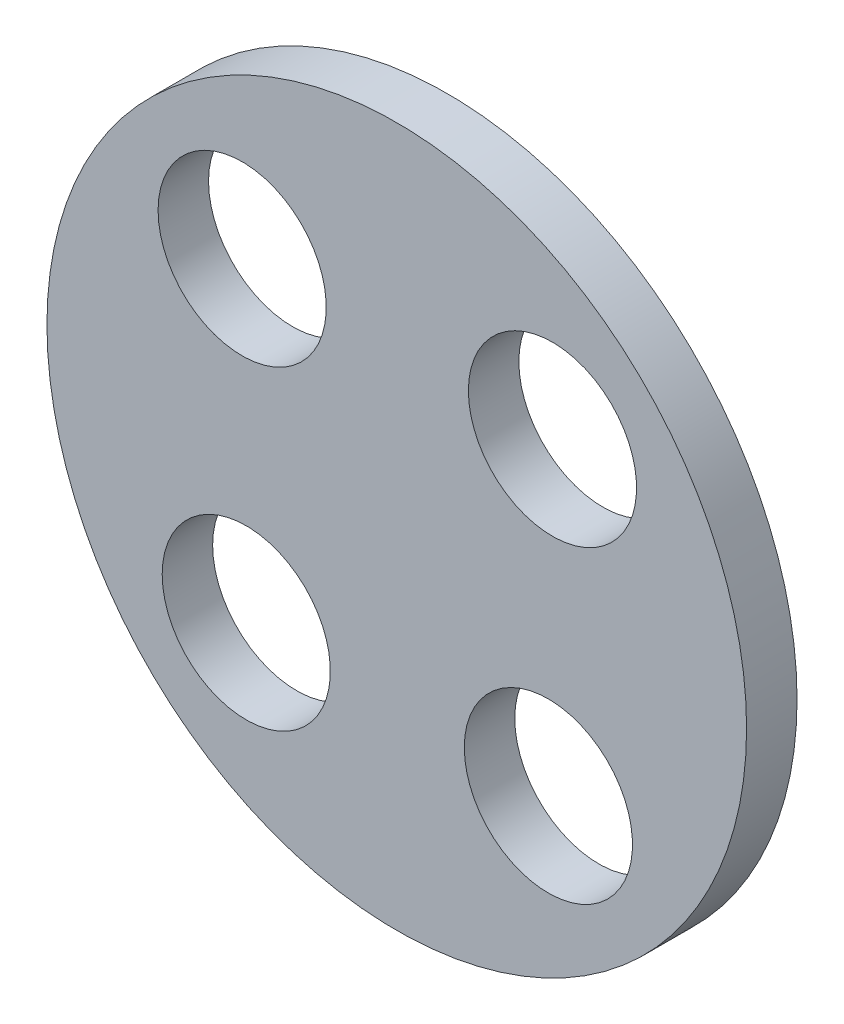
ISO-10303-21;
HEADER;
FILE_DESCRIPTION(('STEP AP214'),'2;1');
FILE_NAME('part.step','',(''),(''),'','','');
FILE_SCHEMA(('AUTOMOTIVE_DESIGN { 1 0 10303 214 1 1 1 1 }'));
ENDSEC;
DATA;
#1=APPLICATION_CONTEXT('core data for automotive mechanical design processes');
#2=APPLICATION_PROTOCOL_DEFINITION('international standard','automotive_design',2000,#1);
#3=PRODUCT_CONTEXT('',#1,'mechanical');
#4=PRODUCT('Part','Part','',(#3));
#5=PRODUCT_RELATED_PRODUCT_CATEGORY('part','',(#4));
#6=PRODUCT_DEFINITION_FORMATION('','',#4);
#7=PRODUCT_DEFINITION_CONTEXT('part definition',#1,'design');
#8=PRODUCT_DEFINITION('design','',#6,#7);
#9=PRODUCT_DEFINITION_SHAPE('','',#8);
#10=(LENGTH_UNIT() NAMED_UNIT(*) SI_UNIT(.MILLI.,.METRE.));
#11=(NAMED_UNIT(*) PLANE_ANGLE_UNIT() SI_UNIT($,.RADIAN.));
#12=(NAMED_UNIT(*) SI_UNIT($,.STERADIAN.) SOLID_ANGLE_UNIT());
#13=UNCERTAINTY_MEASURE_WITH_UNIT(LENGTH_MEASURE(1.E-05),#10,'distance_accuracy_value','');
#14=(GEOMETRIC_REPRESENTATION_CONTEXT(3) GLOBAL_UNCERTAINTY_ASSIGNED_CONTEXT((#13)) GLOBAL_UNIT_ASSIGNED_CONTEXT((#10,
#11,#12)) REPRESENTATION_CONTEXT('',''));
#15=CARTESIAN_POINT('',(0.,0.,0.));
#16=DIRECTION('',(0.,0.,1.));
#17=DIRECTION('',(1.,0.,0.));
#18=AXIS2_PLACEMENT_3D('',#15,#16,#17);
#19=CARTESIAN_POINT('',(0.,0.,3.81));
#20=DIRECTION('',(0.,0.,1.));
#21=DIRECTION('',(1.,0.,0.));
#22=AXIS2_PLACEMENT_3D('',#19,#20,#21);
#23=PLANE('',#22);
#24=CARTESIAN_POINT('',(11.4489030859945,-11.8954915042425,3.81));
#25=DIRECTION('',(0.,0.,1.));
#26=DIRECTION('',(1.,0.,0.));
#27=AXIS2_PLACEMENT_3D('',#24,#25,#26);
#28=CIRCLE('',#27,6.35);
#29=CARTESIAN_POINT('',(5.09890308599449,-11.8954915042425,3.81));
#30=VERTEX_POINT('',#29);
#31=EDGE_CURVE('E55',#30,#30,#28,.T.);
#32=ORIENTED_EDGE('',*,*,#31,.F.);
#33=EDGE_LOOP('',(#32));
#34=FACE_BOUND('',#33,.T.);
#35=CARTESIAN_POINT('',(-11.6743329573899,11.6743329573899,3.81));
#36=DIRECTION('',(0.,0.,1.));
#37=DIRECTION('',(1.,0.,0.));
#38=AXIS2_PLACEMENT_3D('',#35,#36,#37);
#39=CIRCLE('',#38,6.35);
#40=CARTESIAN_POINT('',(-18.0243329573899,11.6743329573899,3.81));
#41=VERTEX_POINT('',#40);
#42=EDGE_CURVE('E40',#41,#41,#39,.T.);
#43=ORIENTED_EDGE('',*,*,#42,.F.);
#44=EDGE_LOOP('',(#43));
#45=FACE_BOUND('',#44,.T.);
#46=CARTESIAN_POINT('',(0.,0.,3.81));
#47=DIRECTION('',(0.,0.,1.));
#48=DIRECTION('',(1.,0.,0.));
#49=AXIS2_PLACEMENT_3D('',#46,#47,#48);
#50=CIRCLE('',#49,26.416);
#51=CARTESIAN_POINT('',(-26.416,0.,3.81));
#52=VERTEX_POINT('',#51);
#53=EDGE_CURVE('E10',#52,#52,#50,.T.);
#54=ORIENTED_EDGE('',*,*,#53,.T.);
#55=EDGE_LOOP('',(#54));
#56=FACE_BOUND('',#55,.T.);
#57=CARTESIAN_POINT('',(11.7568886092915,11.5911893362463,3.81));
#58=DIRECTION('',(0.,0.,1.));
#59=DIRECTION('',(1.,0.,0.));
#60=AXIS2_PLACEMENT_3D('',#57,#58,#59);
#61=CIRCLE('',#60,6.35);
#62=CARTESIAN_POINT('',(5.40688860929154,11.5911893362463,3.81));
#63=VERTEX_POINT('',#62);
#64=EDGE_CURVE('E49',#63,#63,#61,.T.);
#65=ORIENTED_EDGE('',*,*,#64,.F.);
#66=EDGE_LOOP('',(#65));
#67=FACE_BOUND('',#66,.T.);
#68=CARTESIAN_POINT('',(-11.3642808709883,-11.9763608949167,3.81));
#69=DIRECTION('',(0.,0.,1.));
#70=DIRECTION('',(1.,0.,0.));
#71=AXIS2_PLACEMENT_3D('',#68,#69,#70);
#72=CIRCLE('',#71,6.35);
#73=CARTESIAN_POINT('',(-17.7142808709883,-11.9763608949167,3.81));
#74=VERTEX_POINT('',#73);
#75=EDGE_CURVE('E61',#74,#74,#72,.T.);
#76=ORIENTED_EDGE('',*,*,#75,.F.);
#77=EDGE_LOOP('',(#76));
#78=FACE_BOUND('',#77,.T.);
#79=ADVANCED_FACE('F29',(#34,#45,#56,#67,#78),#23,.T.);
#80=CARTESIAN_POINT('',(0.,0.,0.));
#81=DIRECTION('',(0.,0.,1.));
#82=DIRECTION('',(1.,0.,0.));
#83=AXIS2_PLACEMENT_3D('',#80,#81,#82);
#84=PLANE('',#83);
#85=CARTESIAN_POINT('',(11.4489030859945,-11.8954915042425,0.));
#86=DIRECTION('',(0.,0.,1.));
#87=DIRECTION('',(1.,0.,0.));
#88=AXIS2_PLACEMENT_3D('',#85,#86,#87);
#89=CIRCLE('',#88,6.35);
#90=CARTESIAN_POINT('',(5.09890308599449,-11.8954915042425,0.));
#91=VERTEX_POINT('',#90);
#92=EDGE_CURVE('E58',#91,#91,#89,.T.);
#93=ORIENTED_EDGE('',*,*,#92,.T.);
#94=EDGE_LOOP('',(#93));
#95=FACE_BOUND('',#94,.T.);
#96=CARTESIAN_POINT('',(-11.6743329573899,11.6743329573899,0.));
#97=DIRECTION('',(0.,0.,1.));
#98=DIRECTION('',(1.,0.,0.));
#99=AXIS2_PLACEMENT_3D('',#96,#97,#98);
#100=CIRCLE('',#99,6.35);
#101=CARTESIAN_POINT('',(-18.0243329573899,11.6743329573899,0.));
#102=VERTEX_POINT('',#101);
#103=EDGE_CURVE('E44',#102,#102,#100,.T.);
#104=ORIENTED_EDGE('',*,*,#103,.T.);
#105=EDGE_LOOP('',(#104));
#106=FACE_BOUND('',#105,.T.);
#107=CARTESIAN_POINT('',(0.,0.,0.));
#108=DIRECTION('',(0.,0.,1.));
#109=DIRECTION('',(1.,0.,0.));
#110=AXIS2_PLACEMENT_3D('',#107,#108,#109);
#111=CIRCLE('',#110,26.416);
#112=CARTESIAN_POINT('',(-26.416,0.,0.));
#113=VERTEX_POINT('',#112);
#114=EDGE_CURVE('E36',#113,#113,#111,.T.);
#115=ORIENTED_EDGE('',*,*,#114,.F.);
#116=EDGE_LOOP('',(#115));
#117=FACE_BOUND('',#116,.T.);
#118=CARTESIAN_POINT('',(11.7568886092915,11.5911893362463,0.));
#119=DIRECTION('',(0.,0.,1.));
#120=DIRECTION('',(1.,0.,0.));
#121=AXIS2_PLACEMENT_3D('',#118,#119,#120);
#122=CIRCLE('',#121,6.35);
#123=CARTESIAN_POINT('',(5.40688860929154,11.5911893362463,0.));
#124=VERTEX_POINT('',#123);
#125=EDGE_CURVE('E52',#124,#124,#122,.T.);
#126=ORIENTED_EDGE('',*,*,#125,.T.);
#127=EDGE_LOOP('',(#126));
#128=FACE_BOUND('',#127,.T.);
#129=CARTESIAN_POINT('',(-11.3642808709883,-11.9763608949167,0.));
#130=DIRECTION('',(0.,0.,1.));
#131=DIRECTION('',(1.,0.,0.));
#132=AXIS2_PLACEMENT_3D('',#129,#130,#131);
#133=CIRCLE('',#132,6.35);
#134=CARTESIAN_POINT('',(-17.7142808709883,-11.9763608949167,0.));
#135=VERTEX_POINT('',#134);
#136=EDGE_CURVE('E64',#135,#135,#133,.T.);
#137=ORIENTED_EDGE('',*,*,#136,.T.);
#138=EDGE_LOOP('',(#137));
#139=FACE_BOUND('',#138,.T.);
#140=ADVANCED_FACE('F68',(#95,#106,#117,#128,#139),#84,.F.);
#141=CARTESIAN_POINT('',(0.,0.,3.81));
#142=DIRECTION('',(0.,0.,-1.));
#143=DIRECTION('',(-1.,0.,0.));
#144=AXIS2_PLACEMENT_3D('',#141,#142,#143);
#145=CYLINDRICAL_SURFACE('',#144,26.416);
#146=CARTESIAN_POINT('',(-26.416,0.,3.81));
#147=CARTESIAN_POINT('',(-26.416,0.,3.7703125));
#148=CARTESIAN_POINT('',(-26.416,0.,3.730625));
#149=CARTESIAN_POINT('',(-26.416,0.,3.65125));
#150=CARTESIAN_POINT('',(-26.416,0.,3.6115625));
#151=CARTESIAN_POINT('',(-26.416,0.,3.5321875));
#152=CARTESIAN_POINT('',(-26.416,0.,3.4925));
#153=CARTESIAN_POINT('',(-26.416,0.,3.413125));
#154=CARTESIAN_POINT('',(-26.416,0.,3.3734375));
#155=CARTESIAN_POINT('',(-26.416,0.,3.2940625));
#156=CARTESIAN_POINT('',(-26.416,0.,3.254375));
#157=CARTESIAN_POINT('',(-26.416,0.,3.175));
#158=CARTESIAN_POINT('',(-26.416,0.,3.1353125));
#159=CARTESIAN_POINT('',(-26.416,0.,3.0559375));
#160=CARTESIAN_POINT('',(-26.416,0.,3.01625));
#161=CARTESIAN_POINT('',(-26.416,0.,2.936875));
#162=CARTESIAN_POINT('',(-26.416,0.,2.8971875));
#163=CARTESIAN_POINT('',(-26.416,0.,2.8178125));
#164=CARTESIAN_POINT('',(-26.416,0.,2.778125));
#165=CARTESIAN_POINT('',(-26.416,0.,2.69875));
#166=CARTESIAN_POINT('',(-26.416,0.,2.6590625));
#167=CARTESIAN_POINT('',(-26.416,0.,2.5796875));
#168=CARTESIAN_POINT('',(-26.416,0.,2.54));
#169=CARTESIAN_POINT('',(-26.416,0.,2.460625));
#170=CARTESIAN_POINT('',(-26.416,0.,2.4209375));
#171=CARTESIAN_POINT('',(-26.416,0.,2.3415625));
#172=CARTESIAN_POINT('',(-26.416,0.,2.301875));
#173=CARTESIAN_POINT('',(-26.416,0.,2.2225));
#174=CARTESIAN_POINT('',(-26.416,0.,2.1828125));
#175=CARTESIAN_POINT('',(-26.416,0.,2.1034375));
#176=CARTESIAN_POINT('',(-26.416,0.,2.06375));
#177=CARTESIAN_POINT('',(-26.416,0.,1.984375));
#178=CARTESIAN_POINT('',(-26.416,0.,1.9446875));
#179=CARTESIAN_POINT('',(-26.416,0.,1.8653125));
#180=CARTESIAN_POINT('',(-26.416,0.,1.825625));
#181=CARTESIAN_POINT('',(-26.416,0.,1.74625));
#182=CARTESIAN_POINT('',(-26.416,0.,1.7065625));
#183=CARTESIAN_POINT('',(-26.416,0.,1.6271875));
#184=CARTESIAN_POINT('',(-26.416,0.,1.5875));
#185=CARTESIAN_POINT('',(-26.416,0.,1.508125));
#186=CARTESIAN_POINT('',(-26.416,0.,1.4684375));
#187=CARTESIAN_POINT('',(-26.416,0.,1.3890625));
#188=CARTESIAN_POINT('',(-26.416,0.,1.349375));
#189=CARTESIAN_POINT('',(-26.416,0.,1.27));
#190=CARTESIAN_POINT('',(-26.416,0.,1.2303125));
#191=CARTESIAN_POINT('',(-26.416,0.,1.1509375));
#192=CARTESIAN_POINT('',(-26.416,0.,1.11125));
#193=CARTESIAN_POINT('',(-26.416,0.,1.031875));
#194=CARTESIAN_POINT('',(-26.416,0.,0.9921875));
#195=CARTESIAN_POINT('',(-26.416,0.,0.9128125));
#196=CARTESIAN_POINT('',(-26.416,0.,0.873125));
#197=CARTESIAN_POINT('',(-26.416,0.,0.79375));
#198=CARTESIAN_POINT('',(-26.416,0.,0.7540625));
#199=CARTESIAN_POINT('',(-26.416,0.,0.6746875));
#200=CARTESIAN_POINT('',(-26.416,0.,0.635));
#201=CARTESIAN_POINT('',(-26.416,0.,0.555625));
#202=CARTESIAN_POINT('',(-26.416,0.,0.5159375));
#203=CARTESIAN_POINT('',(-26.416,0.,0.4365625));
#204=CARTESIAN_POINT('',(-26.416,0.,0.396875));
#205=CARTESIAN_POINT('',(-26.416,0.,0.3175));
#206=CARTESIAN_POINT('',(-26.416,0.,0.2778125));
#207=CARTESIAN_POINT('',(-26.416,0.,0.1984375));
#208=CARTESIAN_POINT('',(-26.416,0.,0.15875));
#209=CARTESIAN_POINT('',(-26.416,0.,0.0793749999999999));
#210=CARTESIAN_POINT('',(-26.416,0.,0.0396874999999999));
#211=CARTESIAN_POINT('',(-26.416,0.,0.));
#212=B_SPLINE_CURVE_WITH_KNOTS('',3,(#146,#147,#148,#149,#150,#151,#152,#153,#154,#155,#156,
#157,#158,#159,#160,#161,#162,#163,#164,#165,#166,#167,#168,#169,#170,#171,#172,#173,#174,#175,
#176,#177,#178,#179,#180,#181,#182,#183,#184,#185,#186,#187,#188,#189,#190,#191,#192,#193,#194,
#195,#196,#197,#198,#199,#200,#201,#202,#203,#204,#205,#206,#207,#208,#209,#210,#211),
.UNSPECIFIED.,.F.,.F.,(4,2,2,2,2,2,2,2,2,2,2,2,2,2,2,2,2,2,2,2,2,2,2,2,2,2,2,2,2,2,2,2,4),(0.,
0.1190625,0.238125,0.3571875,0.47625,0.5953125,0.714375,0.8334375,0.9525,1.0715625,1.190625,
1.3096875,1.42875,1.5478125,1.666875,1.7859375,1.905,2.0240625,2.143125,2.2621875,2.38125,
2.5003125,2.619375,2.7384375,2.8575,2.9765625,3.095625,3.2146875,3.33375,3.4528125,3.571875,
3.6909375,3.81),.UNSPECIFIED.);
#213=EDGE_CURVE('BSEAM31',#52,#113,#212,.T.);
#214=ORIENTED_EDGE('',*,*,#53,.F.);
#215=ORIENTED_EDGE('',*,*,#114,.T.);
#216=ORIENTED_EDGE('',*,*,#213,.T.);
#217=ORIENTED_EDGE('',*,*,#213,.F.);
#218=EDGE_LOOP('',(#214,#216,#215,#217));
#219=FACE_BOUND('',#218,.T.);
#220=ADVANCED_FACE('F31',(#219),#145,.T.);
#221=CARTESIAN_POINT('',(-11.6743329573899,11.6743329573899,3.81));
#222=DIRECTION('',(0.,0.,-1.));
#223=DIRECTION('',(-1.,0.,0.));
#224=AXIS2_PLACEMENT_3D('',#221,#222,#223);
#225=CYLINDRICAL_SURFACE('',#224,6.35);
#226=CARTESIAN_POINT('',(-18.0243329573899,11.6743329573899,3.81));
#227=CARTESIAN_POINT('',(-18.0243329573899,11.6743329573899,3.7703125));
#228=CARTESIAN_POINT('',(-18.0243329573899,11.6743329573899,3.730625));
#229=CARTESIAN_POINT('',(-18.0243329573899,11.6743329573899,3.65125));
#230=CARTESIAN_POINT('',(-18.0243329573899,11.6743329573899,3.6115625));
#231=CARTESIAN_POINT('',(-18.0243329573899,11.6743329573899,3.5321875));
#232=CARTESIAN_POINT('',(-18.0243329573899,11.6743329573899,3.4925));
#233=CARTESIAN_POINT('',(-18.0243329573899,11.6743329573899,3.413125));
#234=CARTESIAN_POINT('',(-18.0243329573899,11.6743329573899,3.3734375));
#235=CARTESIAN_POINT('',(-18.0243329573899,11.6743329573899,3.2940625));
#236=CARTESIAN_POINT('',(-18.0243329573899,11.6743329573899,3.254375));
#237=CARTESIAN_POINT('',(-18.0243329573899,11.6743329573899,3.175));
#238=CARTESIAN_POINT('',(-18.0243329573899,11.6743329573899,3.1353125));
#239=CARTESIAN_POINT('',(-18.0243329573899,11.6743329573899,3.0559375));
#240=CARTESIAN_POINT('',(-18.0243329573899,11.6743329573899,3.01625));
#241=CARTESIAN_POINT('',(-18.0243329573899,11.6743329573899,2.936875));
#242=CARTESIAN_POINT('',(-18.0243329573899,11.6743329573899,2.8971875));
#243=CARTESIAN_POINT('',(-18.0243329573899,11.6743329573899,2.8178125));
#244=CARTESIAN_POINT('',(-18.0243329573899,11.6743329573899,2.778125));
#245=CARTESIAN_POINT('',(-18.0243329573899,11.6743329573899,2.69875));
#246=CARTESIAN_POINT('',(-18.0243329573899,11.6743329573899,2.6590625));
#247=CARTESIAN_POINT('',(-18.0243329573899,11.6743329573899,2.5796875));
#248=CARTESIAN_POINT('',(-18.0243329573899,11.6743329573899,2.54));
#249=CARTESIAN_POINT('',(-18.0243329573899,11.6743329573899,2.460625));
#250=CARTESIAN_POINT('',(-18.0243329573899,11.6743329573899,2.4209375));
#251=CARTESIAN_POINT('',(-18.0243329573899,11.6743329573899,2.3415625));
#252=CARTESIAN_POINT('',(-18.0243329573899,11.6743329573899,2.301875));
#253=CARTESIAN_POINT('',(-18.0243329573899,11.6743329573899,2.2225));
#254=CARTESIAN_POINT('',(-18.0243329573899,11.6743329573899,2.1828125));
#255=CARTESIAN_POINT('',(-18.0243329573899,11.6743329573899,2.1034375));
#256=CARTESIAN_POINT('',(-18.0243329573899,11.6743329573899,2.06375));
#257=CARTESIAN_POINT('',(-18.0243329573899,11.6743329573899,1.984375));
#258=CARTESIAN_POINT('',(-18.0243329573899,11.6743329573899,1.9446875));
#259=CARTESIAN_POINT('',(-18.0243329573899,11.6743329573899,1.8653125));
#260=CARTESIAN_POINT('',(-18.0243329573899,11.6743329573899,1.825625));
#261=CARTESIAN_POINT('',(-18.0243329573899,11.6743329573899,1.74625));
#262=CARTESIAN_POINT('',(-18.0243329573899,11.6743329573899,1.7065625));
#263=CARTESIAN_POINT('',(-18.0243329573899,11.6743329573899,1.6271875));
#264=CARTESIAN_POINT('',(-18.0243329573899,11.6743329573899,1.5875));
#265=CARTESIAN_POINT('',(-18.0243329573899,11.6743329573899,1.508125));
#266=CARTESIAN_POINT('',(-18.0243329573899,11.6743329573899,1.4684375));
#267=CARTESIAN_POINT('',(-18.0243329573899,11.6743329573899,1.3890625));
#268=CARTESIAN_POINT('',(-18.0243329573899,11.6743329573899,1.349375));
#269=CARTESIAN_POINT('',(-18.0243329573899,11.6743329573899,1.27));
#270=CARTESIAN_POINT('',(-18.0243329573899,11.6743329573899,1.2303125));
#271=CARTESIAN_POINT('',(-18.0243329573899,11.6743329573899,1.1509375));
#272=CARTESIAN_POINT('',(-18.0243329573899,11.6743329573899,1.11125));
#273=CARTESIAN_POINT('',(-18.0243329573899,11.6743329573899,1.031875));
#274=CARTESIAN_POINT('',(-18.0243329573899,11.6743329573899,0.9921875));
#275=CARTESIAN_POINT('',(-18.0243329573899,11.6743329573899,0.9128125));
#276=CARTESIAN_POINT('',(-18.0243329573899,11.6743329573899,0.873125));
#277=CARTESIAN_POINT('',(-18.0243329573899,11.6743329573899,0.79375));
#278=CARTESIAN_POINT('',(-18.0243329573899,11.6743329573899,0.7540625));
#279=CARTESIAN_POINT('',(-18.0243329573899,11.6743329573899,0.6746875));
#280=CARTESIAN_POINT('',(-18.0243329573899,11.6743329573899,0.635));
#281=CARTESIAN_POINT('',(-18.0243329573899,11.6743329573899,0.555625));
#282=CARTESIAN_POINT('',(-18.0243329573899,11.6743329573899,0.5159375));
#283=CARTESIAN_POINT('',(-18.0243329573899,11.6743329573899,0.4365625));
#284=CARTESIAN_POINT('',(-18.0243329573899,11.6743329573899,0.396875));
#285=CARTESIAN_POINT('',(-18.0243329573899,11.6743329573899,0.3175));
#286=CARTESIAN_POINT('',(-18.0243329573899,11.6743329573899,0.2778125));
#287=CARTESIAN_POINT('',(-18.0243329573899,11.6743329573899,0.1984375));
#288=CARTESIAN_POINT('',(-18.0243329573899,11.6743329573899,0.15875));
#289=CARTESIAN_POINT('',(-18.0243329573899,11.6743329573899,0.0793749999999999));
#290=CARTESIAN_POINT('',(-18.0243329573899,11.6743329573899,0.0396874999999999));
#291=CARTESIAN_POINT('',(-18.0243329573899,11.6743329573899,0.));
#292=B_SPLINE_CURVE_WITH_KNOTS('',3,(#226,#227,#228,#229,#230,#231,#232,#233,#234,#235,#236,
#237,#238,#239,#240,#241,#242,#243,#244,#245,#246,#247,#248,#249,#250,#251,#252,#253,#254,#255,
#256,#257,#258,#259,#260,#261,#262,#263,#264,#265,#266,#267,#268,#269,#270,#271,#272,#273,#274,
#275,#276,#277,#278,#279,#280,#281,#282,#283,#284,#285,#286,#287,#288,#289,#290,#291),
.UNSPECIFIED.,.F.,.F.,(4,2,2,2,2,2,2,2,2,2,2,2,2,2,2,2,2,2,2,2,2,2,2,2,2,2,2,2,2,2,2,2,4),(0.,
0.1190625,0.238125,0.3571875,0.47625,0.5953125,0.714375,0.8334375,0.9525,1.0715625,1.190625,
1.3096875,1.42875,1.5478125,1.666875,1.7859375,1.905,2.0240625,2.143125,2.2621875,2.38125,
2.5003125,2.619375,2.7384375,2.8575,2.9765625,3.095625,3.2146875,3.33375,3.4528125,3.571875,
3.6909375,3.81),.UNSPECIFIED.);
#293=EDGE_CURVE('BSEAM91',#41,#102,#292,.T.);
#294=ORIENTED_EDGE('',*,*,#42,.T.);
#295=ORIENTED_EDGE('',*,*,#103,.F.);
#296=ORIENTED_EDGE('',*,*,#293,.T.);
#297=ORIENTED_EDGE('',*,*,#293,.F.);
#298=EDGE_LOOP('',(#294,#296,#295,#297));
#299=FACE_BOUND('',#298,.T.);
#300=ADVANCED_FACE('F91',(#299),#225,.F.);
#301=CARTESIAN_POINT('',(11.7568886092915,11.5911893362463,3.81));
#302=DIRECTION('',(0.,0.,-1.));
#303=DIRECTION('',(-1.,0.,0.));
#304=AXIS2_PLACEMENT_3D('',#301,#302,#303);
#305=CYLINDRICAL_SURFACE('',#304,6.35);
#306=CARTESIAN_POINT('',(5.40688860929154,11.5911893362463,3.81));
#307=CARTESIAN_POINT('',(5.40688860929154,11.5911893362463,3.7703125));
#308=CARTESIAN_POINT('',(5.40688860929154,11.5911893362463,3.730625));
#309=CARTESIAN_POINT('',(5.40688860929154,11.5911893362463,3.65125));
#310=CARTESIAN_POINT('',(5.40688860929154,11.5911893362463,3.6115625));
#311=CARTESIAN_POINT('',(5.40688860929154,11.5911893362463,3.5321875));
#312=CARTESIAN_POINT('',(5.40688860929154,11.5911893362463,3.4925));
#313=CARTESIAN_POINT('',(5.40688860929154,11.5911893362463,3.413125));
#314=CARTESIAN_POINT('',(5.40688860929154,11.5911893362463,3.3734375));
#315=CARTESIAN_POINT('',(5.40688860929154,11.5911893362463,3.2940625));
#316=CARTESIAN_POINT('',(5.40688860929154,11.5911893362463,3.254375));
#317=CARTESIAN_POINT('',(5.40688860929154,11.5911893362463,3.175));
#318=CARTESIAN_POINT('',(5.40688860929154,11.5911893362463,3.1353125));
#319=CARTESIAN_POINT('',(5.40688860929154,11.5911893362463,3.0559375));
#320=CARTESIAN_POINT('',(5.40688860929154,11.5911893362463,3.01625));
#321=CARTESIAN_POINT('',(5.40688860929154,11.5911893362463,2.936875));
#322=CARTESIAN_POINT('',(5.40688860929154,11.5911893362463,2.8971875));
#323=CARTESIAN_POINT('',(5.40688860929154,11.5911893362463,2.8178125));
#324=CARTESIAN_POINT('',(5.40688860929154,11.5911893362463,2.778125));
#325=CARTESIAN_POINT('',(5.40688860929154,11.5911893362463,2.69875));
#326=CARTESIAN_POINT('',(5.40688860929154,11.5911893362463,2.6590625));
#327=CARTESIAN_POINT('',(5.40688860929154,11.5911893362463,2.5796875));
#328=CARTESIAN_POINT('',(5.40688860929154,11.5911893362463,2.54));
#329=CARTESIAN_POINT('',(5.40688860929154,11.5911893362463,2.460625));
#330=CARTESIAN_POINT('',(5.40688860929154,11.5911893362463,2.4209375));
#331=CARTESIAN_POINT('',(5.40688860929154,11.5911893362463,2.3415625));
#332=CARTESIAN_POINT('',(5.40688860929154,11.5911893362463,2.301875));
#333=CARTESIAN_POINT('',(5.40688860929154,11.5911893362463,2.2225));
#334=CARTESIAN_POINT('',(5.40688860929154,11.5911893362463,2.1828125));
#335=CARTESIAN_POINT('',(5.40688860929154,11.5911893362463,2.1034375));
#336=CARTESIAN_POINT('',(5.40688860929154,11.5911893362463,2.06375));
#337=CARTESIAN_POINT('',(5.40688860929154,11.5911893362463,1.984375));
#338=CARTESIAN_POINT('',(5.40688860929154,11.5911893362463,1.9446875));
#339=CARTESIAN_POINT('',(5.40688860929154,11.5911893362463,1.8653125));
#340=CARTESIAN_POINT('',(5.40688860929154,11.5911893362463,1.825625));
#341=CARTESIAN_POINT('',(5.40688860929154,11.5911893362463,1.74625));
#342=CARTESIAN_POINT('',(5.40688860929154,11.5911893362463,1.7065625));
#343=CARTESIAN_POINT('',(5.40688860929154,11.5911893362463,1.6271875));
#344=CARTESIAN_POINT('',(5.40688860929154,11.5911893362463,1.5875));
#345=CARTESIAN_POINT('',(5.40688860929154,11.5911893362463,1.508125));
#346=CARTESIAN_POINT('',(5.40688860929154,11.5911893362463,1.4684375));
#347=CARTESIAN_POINT('',(5.40688860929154,11.5911893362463,1.3890625));
#348=CARTESIAN_POINT('',(5.40688860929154,11.5911893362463,1.349375));
#349=CARTESIAN_POINT('',(5.40688860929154,11.5911893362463,1.27));
#350=CARTESIAN_POINT('',(5.40688860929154,11.5911893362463,1.2303125));
#351=CARTESIAN_POINT('',(5.40688860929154,11.5911893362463,1.1509375));
#352=CARTESIAN_POINT('',(5.40688860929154,11.5911893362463,1.11125));
#353=CARTESIAN_POINT('',(5.40688860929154,11.5911893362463,1.031875));
#354=CARTESIAN_POINT('',(5.40688860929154,11.5911893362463,0.9921875));
#355=CARTESIAN_POINT('',(5.40688860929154,11.5911893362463,0.9128125));
#356=CARTESIAN_POINT('',(5.40688860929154,11.5911893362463,0.873125));
#357=CARTESIAN_POINT('',(5.40688860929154,11.5911893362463,0.79375));
#358=CARTESIAN_POINT('',(5.40688860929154,11.5911893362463,0.7540625));
#359=CARTESIAN_POINT('',(5.40688860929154,11.5911893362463,0.6746875));
#360=CARTESIAN_POINT('',(5.40688860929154,11.5911893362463,0.635));
#361=CARTESIAN_POINT('',(5.40688860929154,11.5911893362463,0.555625));
#362=CARTESIAN_POINT('',(5.40688860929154,11.5911893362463,0.5159375));
#363=CARTESIAN_POINT('',(5.40688860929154,11.5911893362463,0.4365625));
#364=CARTESIAN_POINT('',(5.40688860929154,11.5911893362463,0.396875));
#365=CARTESIAN_POINT('',(5.40688860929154,11.5911893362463,0.3175));
#366=CARTESIAN_POINT('',(5.40688860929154,11.5911893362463,0.2778125));
#367=CARTESIAN_POINT('',(5.40688860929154,11.5911893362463,0.1984375));
#368=CARTESIAN_POINT('',(5.40688860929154,11.5911893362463,0.15875));
#369=CARTESIAN_POINT('',(5.40688860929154,11.5911893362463,0.0793749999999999));
#370=CARTESIAN_POINT('',(5.40688860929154,11.5911893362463,0.0396874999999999));
#371=CARTESIAN_POINT('',(5.40688860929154,11.5911893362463,0.));
#372=B_SPLINE_CURVE_WITH_KNOTS('',3,(#306,#307,#308,#309,#310,#311,#312,#313,#314,#315,#316,
#317,#318,#319,#320,#321,#322,#323,#324,#325,#326,#327,#328,#329,#330,#331,#332,#333,#334,#335,
#336,#337,#338,#339,#340,#341,#342,#343,#344,#345,#346,#347,#348,#349,#350,#351,#352,#353,#354,
#355,#356,#357,#358,#359,#360,#361,#362,#363,#364,#365,#366,#367,#368,#369,#370,#371),
.UNSPECIFIED.,.F.,.F.,(4,2,2,2,2,2,2,2,2,2,2,2,2,2,2,2,2,2,2,2,2,2,2,2,2,2,2,2,2,2,2,2,4),(0.,
0.1190625,0.238125,0.3571875,0.47625,0.5953125,0.714375,0.8334375,0.9525,1.0715625,1.190625,
1.3096875,1.42875,1.5478125,1.666875,1.7859375,1.905,2.0240625,2.143125,2.2621875,2.38125,
2.5003125,2.619375,2.7384375,2.8575,2.9765625,3.095625,3.2146875,3.33375,3.4528125,3.571875,
3.6909375,3.81),.UNSPECIFIED.);
#373=EDGE_CURVE('BSEAM78',#63,#124,#372,.T.);
#374=ORIENTED_EDGE('',*,*,#64,.T.);
#375=ORIENTED_EDGE('',*,*,#125,.F.);
#376=ORIENTED_EDGE('',*,*,#373,.T.);
#377=ORIENTED_EDGE('',*,*,#373,.F.);
#378=EDGE_LOOP('',(#374,#376,#375,#377));
#379=FACE_BOUND('',#378,.T.);
#380=ADVANCED_FACE('F78',(#379),#305,.F.);
#381=CARTESIAN_POINT('',(11.4489030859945,-11.8954915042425,3.81));
#382=DIRECTION('',(0.,0.,-1.));
#383=DIRECTION('',(-1.,0.,0.));
#384=AXIS2_PLACEMENT_3D('',#381,#382,#383);
#385=CYLINDRICAL_SURFACE('',#384,6.35);
#386=CARTESIAN_POINT('',(5.09890308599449,-11.8954915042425,3.81));
#387=CARTESIAN_POINT('',(5.09890308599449,-11.8954915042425,3.7703125));
#388=CARTESIAN_POINT('',(5.09890308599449,-11.8954915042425,3.730625));
#389=CARTESIAN_POINT('',(5.09890308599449,-11.8954915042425,3.65125));
#390=CARTESIAN_POINT('',(5.09890308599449,-11.8954915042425,3.6115625));
#391=CARTESIAN_POINT('',(5.09890308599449,-11.8954915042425,3.5321875));
#392=CARTESIAN_POINT('',(5.09890308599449,-11.8954915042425,3.4925));
#393=CARTESIAN_POINT('',(5.09890308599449,-11.8954915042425,3.413125));
#394=CARTESIAN_POINT('',(5.09890308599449,-11.8954915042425,3.3734375));
#395=CARTESIAN_POINT('',(5.09890308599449,-11.8954915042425,3.2940625));
#396=CARTESIAN_POINT('',(5.09890308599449,-11.8954915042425,3.254375));
#397=CARTESIAN_POINT('',(5.09890308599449,-11.8954915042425,3.175));
#398=CARTESIAN_POINT('',(5.09890308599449,-11.8954915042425,3.1353125));
#399=CARTESIAN_POINT('',(5.09890308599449,-11.8954915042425,3.0559375));
#400=CARTESIAN_POINT('',(5.09890308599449,-11.8954915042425,3.01625));
#401=CARTESIAN_POINT('',(5.09890308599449,-11.8954915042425,2.936875));
#402=CARTESIAN_POINT('',(5.09890308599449,-11.8954915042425,2.8971875));
#403=CARTESIAN_POINT('',(5.09890308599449,-11.8954915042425,2.8178125));
#404=CARTESIAN_POINT('',(5.09890308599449,-11.8954915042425,2.778125));
#405=CARTESIAN_POINT('',(5.09890308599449,-11.8954915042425,2.69875));
#406=CARTESIAN_POINT('',(5.09890308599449,-11.8954915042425,2.6590625));
#407=CARTESIAN_POINT('',(5.09890308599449,-11.8954915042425,2.5796875));
#408=CARTESIAN_POINT('',(5.09890308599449,-11.8954915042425,2.54));
#409=CARTESIAN_POINT('',(5.09890308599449,-11.8954915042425,2.460625));
#410=CARTESIAN_POINT('',(5.09890308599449,-11.8954915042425,2.4209375));
#411=CARTESIAN_POINT('',(5.09890308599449,-11.8954915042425,2.3415625));
#412=CARTESIAN_POINT('',(5.09890308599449,-11.8954915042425,2.301875));
#413=CARTESIAN_POINT('',(5.09890308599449,-11.8954915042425,2.2225));
#414=CARTESIAN_POINT('',(5.09890308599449,-11.8954915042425,2.1828125));
#415=CARTESIAN_POINT('',(5.09890308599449,-11.8954915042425,2.1034375));
#416=CARTESIAN_POINT('',(5.09890308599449,-11.8954915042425,2.06375));
#417=CARTESIAN_POINT('',(5.09890308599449,-11.8954915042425,1.984375));
#418=CARTESIAN_POINT('',(5.09890308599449,-11.8954915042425,1.9446875));
#419=CARTESIAN_POINT('',(5.09890308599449,-11.8954915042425,1.8653125));
#420=CARTESIAN_POINT('',(5.09890308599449,-11.8954915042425,1.825625));
#421=CARTESIAN_POINT('',(5.09890308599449,-11.8954915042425,1.74625));
#422=CARTESIAN_POINT('',(5.09890308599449,-11.8954915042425,1.7065625));
#423=CARTESIAN_POINT('',(5.09890308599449,-11.8954915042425,1.6271875));
#424=CARTESIAN_POINT('',(5.09890308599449,-11.8954915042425,1.5875));
#425=CARTESIAN_POINT('',(5.09890308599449,-11.8954915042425,1.508125));
#426=CARTESIAN_POINT('',(5.09890308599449,-11.8954915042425,1.4684375));
#427=CARTESIAN_POINT('',(5.09890308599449,-11.8954915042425,1.3890625));
#428=CARTESIAN_POINT('',(5.09890308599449,-11.8954915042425,1.349375));
#429=CARTESIAN_POINT('',(5.09890308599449,-11.8954915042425,1.27));
#430=CARTESIAN_POINT('',(5.09890308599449,-11.8954915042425,1.2303125));
#431=CARTESIAN_POINT('',(5.09890308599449,-11.8954915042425,1.1509375));
#432=CARTESIAN_POINT('',(5.09890308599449,-11.8954915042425,1.11125));
#433=CARTESIAN_POINT('',(5.09890308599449,-11.8954915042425,1.031875));
#434=CARTESIAN_POINT('',(5.09890308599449,-11.8954915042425,0.9921875));
#435=CARTESIAN_POINT('',(5.09890308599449,-11.8954915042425,0.9128125));
#436=CARTESIAN_POINT('',(5.09890308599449,-11.8954915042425,0.873125));
#437=CARTESIAN_POINT('',(5.09890308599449,-11.8954915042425,0.79375));
#438=CARTESIAN_POINT('',(5.09890308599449,-11.8954915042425,0.7540625));
#439=CARTESIAN_POINT('',(5.09890308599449,-11.8954915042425,0.6746875));
#440=CARTESIAN_POINT('',(5.09890308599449,-11.8954915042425,0.635));
#441=CARTESIAN_POINT('',(5.09890308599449,-11.8954915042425,0.555625));
#442=CARTESIAN_POINT('',(5.09890308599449,-11.8954915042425,0.5159375));
#443=CARTESIAN_POINT('',(5.09890308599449,-11.8954915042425,0.4365625));
#444=CARTESIAN_POINT('',(5.09890308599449,-11.8954915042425,0.396875));
#445=CARTESIAN_POINT('',(5.09890308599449,-11.8954915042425,0.3175));
#446=CARTESIAN_POINT('',(5.09890308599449,-11.8954915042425,0.2778125));
#447=CARTESIAN_POINT('',(5.09890308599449,-11.8954915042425,0.1984375));
#448=CARTESIAN_POINT('',(5.09890308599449,-11.8954915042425,0.15875));
#449=CARTESIAN_POINT('',(5.09890308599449,-11.8954915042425,0.0793749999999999));
#450=CARTESIAN_POINT('',(5.09890308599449,-11.8954915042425,0.0396874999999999));
#451=CARTESIAN_POINT('',(5.09890308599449,-11.8954915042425,0.));
#452=B_SPLINE_CURVE_WITH_KNOTS('',3,(#386,#387,#388,#389,#390,#391,#392,#393,#394,#395,#396,
#397,#398,#399,#400,#401,#402,#403,#404,#405,#406,#407,#408,#409,#410,#411,#412,#413,#414,#415,
#416,#417,#418,#419,#420,#421,#422,#423,#424,#425,#426,#427,#428,#429,#430,#431,#432,#433,#434,
#435,#436,#437,#438,#439,#440,#441,#442,#443,#444,#445,#446,#447,#448,#449,#450,#451),
.UNSPECIFIED.,.F.,.F.,(4,2,2,2,2,2,2,2,2,2,2,2,2,2,2,2,2,2,2,2,2,2,2,2,2,2,2,2,2,2,2,2,4),(0.,
0.1190625,0.238125,0.3571875,0.47625,0.5953125,0.714375,0.8334375,0.9525,1.0715625,1.190625,
1.3096875,1.42875,1.5478125,1.666875,1.7859375,1.905,2.0240625,2.143125,2.2621875,2.38125,
2.5003125,2.619375,2.7384375,2.8575,2.9765625,3.095625,3.2146875,3.33375,3.4528125,3.571875,
3.6909375,3.81),.UNSPECIFIED.);
#453=EDGE_CURVE('BSEAM72',#30,#91,#452,.T.);
#454=ORIENTED_EDGE('',*,*,#31,.T.);
#455=ORIENTED_EDGE('',*,*,#92,.F.);
#456=ORIENTED_EDGE('',*,*,#453,.T.);
#457=ORIENTED_EDGE('',*,*,#453,.F.);
#458=EDGE_LOOP('',(#454,#456,#455,#457));
#459=FACE_BOUND('',#458,.T.);
#460=ADVANCED_FACE('F72',(#459),#385,.F.);
#461=CARTESIAN_POINT('',(-11.3642808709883,-11.9763608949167,3.81));
#462=DIRECTION('',(0.,0.,-1.));
#463=DIRECTION('',(-1.,0.,0.));
#464=AXIS2_PLACEMENT_3D('',#461,#462,#463);
#465=CYLINDRICAL_SURFACE('',#464,6.35);
#466=CARTESIAN_POINT('',(-17.7142808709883,-11.9763608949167,3.81));
#467=CARTESIAN_POINT('',(-17.7142808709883,-11.9763608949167,3.7703125));
#468=CARTESIAN_POINT('',(-17.7142808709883,-11.9763608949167,3.730625));
#469=CARTESIAN_POINT('',(-17.7142808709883,-11.9763608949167,3.65125));
#470=CARTESIAN_POINT('',(-17.7142808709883,-11.9763608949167,3.6115625));
#471=CARTESIAN_POINT('',(-17.7142808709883,-11.9763608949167,3.5321875));
#472=CARTESIAN_POINT('',(-17.7142808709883,-11.9763608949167,3.4925));
#473=CARTESIAN_POINT('',(-17.7142808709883,-11.9763608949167,3.413125));
#474=CARTESIAN_POINT('',(-17.7142808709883,-11.9763608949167,3.3734375));
#475=CARTESIAN_POINT('',(-17.7142808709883,-11.9763608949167,3.2940625));
#476=CARTESIAN_POINT('',(-17.7142808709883,-11.9763608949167,3.254375));
#477=CARTESIAN_POINT('',(-17.7142808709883,-11.9763608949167,3.175));
#478=CARTESIAN_POINT('',(-17.7142808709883,-11.9763608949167,3.1353125));
#479=CARTESIAN_POINT('',(-17.7142808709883,-11.9763608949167,3.0559375));
#480=CARTESIAN_POINT('',(-17.7142808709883,-11.9763608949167,3.01625));
#481=CARTESIAN_POINT('',(-17.7142808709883,-11.9763608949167,2.936875));
#482=CARTESIAN_POINT('',(-17.7142808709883,-11.9763608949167,2.8971875));
#483=CARTESIAN_POINT('',(-17.7142808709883,-11.9763608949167,2.8178125));
#484=CARTESIAN_POINT('',(-17.7142808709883,-11.9763608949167,2.778125));
#485=CARTESIAN_POINT('',(-17.7142808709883,-11.9763608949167,2.69875));
#486=CARTESIAN_POINT('',(-17.7142808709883,-11.9763608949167,2.6590625));
#487=CARTESIAN_POINT('',(-17.7142808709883,-11.9763608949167,2.5796875));
#488=CARTESIAN_POINT('',(-17.7142808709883,-11.9763608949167,2.54));
#489=CARTESIAN_POINT('',(-17.7142808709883,-11.9763608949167,2.460625));
#490=CARTESIAN_POINT('',(-17.7142808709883,-11.9763608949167,2.4209375));
#491=CARTESIAN_POINT('',(-17.7142808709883,-11.9763608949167,2.3415625));
#492=CARTESIAN_POINT('',(-17.7142808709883,-11.9763608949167,2.301875));
#493=CARTESIAN_POINT('',(-17.7142808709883,-11.9763608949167,2.2225));
#494=CARTESIAN_POINT('',(-17.7142808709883,-11.9763608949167,2.1828125));
#495=CARTESIAN_POINT('',(-17.7142808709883,-11.9763608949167,2.1034375));
#496=CARTESIAN_POINT('',(-17.7142808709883,-11.9763608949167,2.06375));
#497=CARTESIAN_POINT('',(-17.7142808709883,-11.9763608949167,1.984375));
#498=CARTESIAN_POINT('',(-17.7142808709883,-11.9763608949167,1.9446875));
#499=CARTESIAN_POINT('',(-17.7142808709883,-11.9763608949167,1.8653125));
#500=CARTESIAN_POINT('',(-17.7142808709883,-11.9763608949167,1.825625));
#501=CARTESIAN_POINT('',(-17.7142808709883,-11.9763608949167,1.74625));
#502=CARTESIAN_POINT('',(-17.7142808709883,-11.9763608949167,1.7065625));
#503=CARTESIAN_POINT('',(-17.7142808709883,-11.9763608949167,1.6271875));
#504=CARTESIAN_POINT('',(-17.7142808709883,-11.9763608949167,1.5875));
#505=CARTESIAN_POINT('',(-17.7142808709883,-11.9763608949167,1.508125));
#506=CARTESIAN_POINT('',(-17.7142808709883,-11.9763608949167,1.4684375));
#507=CARTESIAN_POINT('',(-17.7142808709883,-11.9763608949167,1.3890625));
#508=CARTESIAN_POINT('',(-17.7142808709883,-11.9763608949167,1.349375));
#509=CARTESIAN_POINT('',(-17.7142808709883,-11.9763608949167,1.27));
#510=CARTESIAN_POINT('',(-17.7142808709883,-11.9763608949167,1.2303125));
#511=CARTESIAN_POINT('',(-17.7142808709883,-11.9763608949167,1.1509375));
#512=CARTESIAN_POINT('',(-17.7142808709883,-11.9763608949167,1.11125));
#513=CARTESIAN_POINT('',(-17.7142808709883,-11.9763608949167,1.031875));
#514=CARTESIAN_POINT('',(-17.7142808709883,-11.9763608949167,0.9921875));
#515=CARTESIAN_POINT('',(-17.7142808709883,-11.9763608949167,0.9128125));
#516=CARTESIAN_POINT('',(-17.7142808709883,-11.9763608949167,0.873125));
#517=CARTESIAN_POINT('',(-17.7142808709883,-11.9763608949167,0.79375));
#518=CARTESIAN_POINT('',(-17.7142808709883,-11.9763608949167,0.7540625));
#519=CARTESIAN_POINT('',(-17.7142808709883,-11.9763608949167,0.6746875));
#520=CARTESIAN_POINT('',(-17.7142808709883,-11.9763608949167,0.635));
#521=CARTESIAN_POINT('',(-17.7142808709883,-11.9763608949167,0.555625));
#522=CARTESIAN_POINT('',(-17.7142808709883,-11.9763608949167,0.5159375));
#523=CARTESIAN_POINT('',(-17.7142808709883,-11.9763608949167,0.4365625));
#524=CARTESIAN_POINT('',(-17.7142808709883,-11.9763608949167,0.396875));
#525=CARTESIAN_POINT('',(-17.7142808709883,-11.9763608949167,0.3175));
#526=CARTESIAN_POINT('',(-17.7142808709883,-11.9763608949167,0.2778125));
#527=CARTESIAN_POINT('',(-17.7142808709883,-11.9763608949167,0.1984375));
#528=CARTESIAN_POINT('',(-17.7142808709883,-11.9763608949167,0.15875));
#529=CARTESIAN_POINT('',(-17.7142808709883,-11.9763608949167,0.0793749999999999));
#530=CARTESIAN_POINT('',(-17.7142808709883,-11.9763608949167,0.0396874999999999));
#531=CARTESIAN_POINT('',(-17.7142808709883,-11.9763608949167,0.));
#532=B_SPLINE_CURVE_WITH_KNOTS('',3,(#466,#467,#468,#469,#470,#471,#472,#473,#474,#475,#476,
#477,#478,#479,#480,#481,#482,#483,#484,#485,#486,#487,#488,#489,#490,#491,#492,#493,#494,#495,
#496,#497,#498,#499,#500,#501,#502,#503,#504,#505,#506,#507,#508,#509,#510,#511,#512,#513,#514,
#515,#516,#517,#518,#519,#520,#521,#522,#523,#524,#525,#526,#527,#528,#529,#530,#531),
.UNSPECIFIED.,.F.,.F.,(4,2,2,2,2,2,2,2,2,2,2,2,2,2,2,2,2,2,2,2,2,2,2,2,2,2,2,2,2,2,2,2,4),(0.,
0.1190625,0.238125,0.3571875,0.47625,0.5953125,0.714375,0.8334375,0.9525,1.0715625,1.190625,
1.3096875,1.42875,1.5478125,1.666875,1.7859375,1.905,2.0240625,2.143125,2.2621875,2.38125,
2.5003125,2.619375,2.7384375,2.8575,2.9765625,3.095625,3.2146875,3.33375,3.4528125,3.571875,
3.6909375,3.81),.UNSPECIFIED.);
#533=EDGE_CURVE('BSEAM70',#74,#135,#532,.T.);
#534=ORIENTED_EDGE('',*,*,#75,.T.);
#535=ORIENTED_EDGE('',*,*,#136,.F.);
#536=ORIENTED_EDGE('',*,*,#533,.T.);
#537=ORIENTED_EDGE('',*,*,#533,.F.);
#538=EDGE_LOOP('',(#534,#536,#535,#537));
#539=FACE_BOUND('',#538,.T.);
#540=ADVANCED_FACE('F70',(#539),#465,.F.);
#541=CLOSED_SHELL('',(#79,#140,#220,#300,#380,#460,#540));
#542=MANIFOLD_SOLID_BREP('B2',#541);
#543=ADVANCED_BREP_SHAPE_REPRESENTATION('',(#18,#542),#14);
#544=SHAPE_DEFINITION_REPRESENTATION(#9,#543);
ENDSEC;
END-ISO-10303-21;
